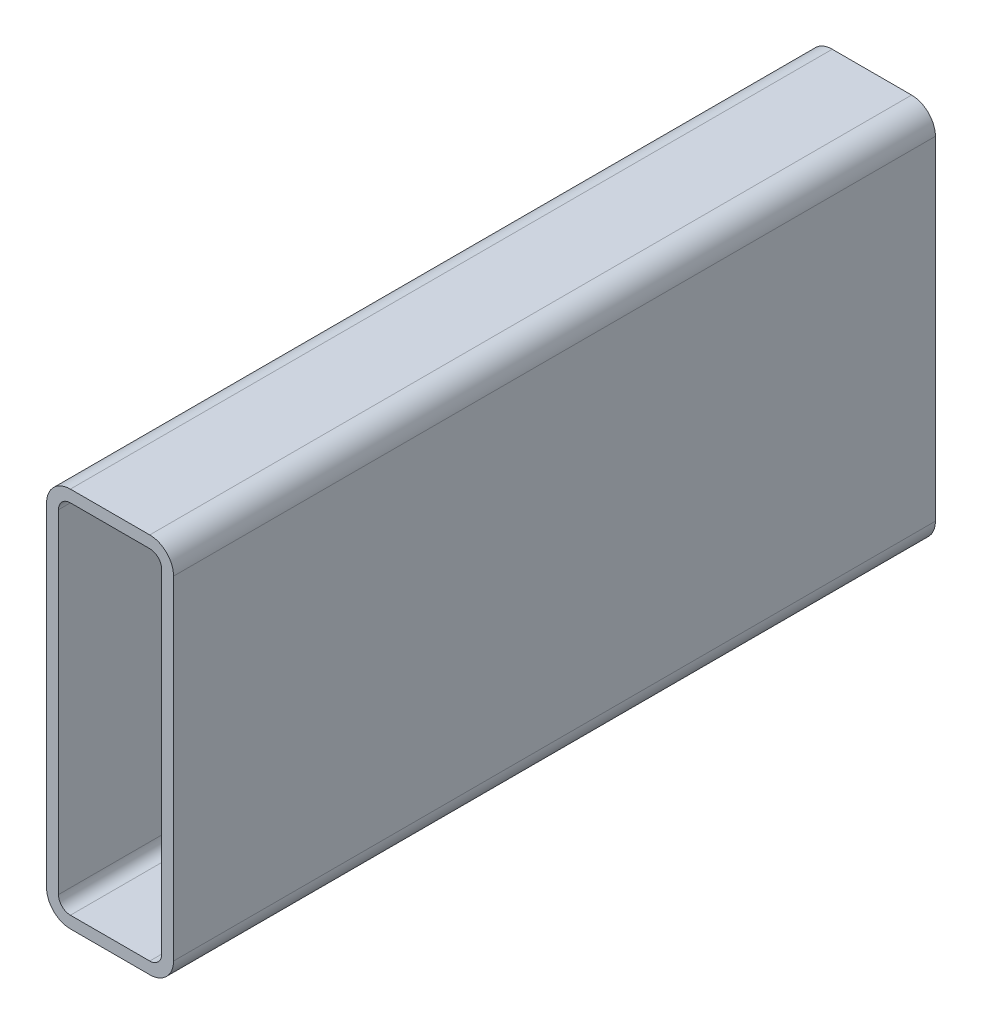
ISO-10303-21;
HEADER;
FILE_DESCRIPTION(('STEP AP214'),'2;1');
FILE_NAME('part.step','',(''),(''),'','','');
FILE_SCHEMA(('AUTOMOTIVE_DESIGN { 1 0 10303 214 1 1 1 1 }'));
ENDSEC;
DATA;
#1=APPLICATION_CONTEXT('core data for automotive mechanical design processes');
#2=APPLICATION_PROTOCOL_DEFINITION('international standard','automotive_design',2000,#1);
#3=PRODUCT_CONTEXT('',#1,'mechanical');
#4=PRODUCT('Part','Part','',(#3));
#5=PRODUCT_RELATED_PRODUCT_CATEGORY('part','',(#4));
#6=PRODUCT_DEFINITION_FORMATION('','',#4);
#7=PRODUCT_DEFINITION_CONTEXT('part definition',#1,'design');
#8=PRODUCT_DEFINITION('design','',#6,#7);
#9=PRODUCT_DEFINITION_SHAPE('','',#8);
#10=(LENGTH_UNIT() NAMED_UNIT(*) SI_UNIT(.MILLI.,.METRE.));
#11=(NAMED_UNIT(*) PLANE_ANGLE_UNIT() SI_UNIT($,.RADIAN.));
#12=(NAMED_UNIT(*) SI_UNIT($,.STERADIAN.) SOLID_ANGLE_UNIT());
#13=UNCERTAINTY_MEASURE_WITH_UNIT(LENGTH_MEASURE(1.E-05),#10,'distance_accuracy_value','');
#14=(GEOMETRIC_REPRESENTATION_CONTEXT(3) GLOBAL_UNCERTAINTY_ASSIGNED_CONTEXT((#13)) GLOBAL_UNIT_ASSIGNED_CONTEXT((#10,
#11,#12)) REPRESENTATION_CONTEXT('',''));
#15=CARTESIAN_POINT('',(0.,0.,0.));
#16=DIRECTION('',(0.,0.,1.));
#17=DIRECTION('',(1.,0.,0.));
#18=AXIS2_PLACEMENT_3D('',#15,#16,#17);
#19=CARTESIAN_POINT('',(9.52500000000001,142.875,304.8));
#20=DIRECTION('',(0.,0.,1.));
#21=DIRECTION('',(1.,0.,0.));
#22=AXIS2_PLACEMENT_3D('',#19,#20,#21);
#23=PLANE('',#22);
#24=CARTESIAN_POINT('',(9.52500000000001,142.875,304.8));
#25=DIRECTION('',(0.,0.,1.));
#26=DIRECTION('',(1.,0.,0.));
#27=AXIS2_PLACEMENT_3D('',#24,#25,#26);
#28=CIRCLE('',#27,9.52500000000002);
#29=CARTESIAN_POINT('',(9.525,152.4,304.8));
#30=VERTEX_POINT('',#29);
#31=CARTESIAN_POINT('',(0.,142.875,304.8));
#32=VERTEX_POINT('',#31);
#33=EDGE_CURVE('E211',#30,#32,#28,.T.);
#34=ORIENTED_EDGE('',*,*,#33,.T.);
#35=DIRECTION('',(0.,-1.,0.));
#36=VECTOR('',#35,1.);
#37=CARTESIAN_POINT('',(0.,9.525,304.8));
#38=LINE('',#37,#36);
#39=CARTESIAN_POINT('',(0.,9.525,304.8));
#40=VERTEX_POINT('',#39);
#41=EDGE_CURVE('E214',#32,#40,#38,.T.);
#42=ORIENTED_EDGE('',*,*,#41,.T.);
#43=CARTESIAN_POINT('',(9.525,9.525,304.8));
#44=DIRECTION('',(0.,0.,1.));
#45=DIRECTION('',(1.,0.,0.));
#46=AXIS2_PLACEMENT_3D('',#43,#44,#45);
#47=CIRCLE('',#46,9.525);
#48=CARTESIAN_POINT('',(9.525,0.,304.8));
#49=VERTEX_POINT('',#48);
#50=EDGE_CURVE('E217',#40,#49,#47,.T.);
#51=ORIENTED_EDGE('',*,*,#50,.T.);
#52=DIRECTION('',(1.,0.,0.));
#53=VECTOR('',#52,1.);
#54=CARTESIAN_POINT('',(41.275,0.,304.8));
#55=LINE('',#54,#53);
#56=CARTESIAN_POINT('',(41.275,0.,304.8));
#57=VERTEX_POINT('',#56);
#58=EDGE_CURVE('E219',#49,#57,#55,.T.);
#59=ORIENTED_EDGE('',*,*,#58,.T.);
#60=CARTESIAN_POINT('',(41.275,9.525,304.8));
#61=DIRECTION('',(0.,0.,1.));
#62=DIRECTION('',(1.,0.,0.));
#63=AXIS2_PLACEMENT_3D('',#60,#61,#62);
#64=CIRCLE('',#63,9.525);
#65=CARTESIAN_POINT('',(50.8,9.525,304.8));
#66=VERTEX_POINT('',#65);
#67=EDGE_CURVE('E221',#57,#66,#64,.T.);
#68=ORIENTED_EDGE('',*,*,#67,.T.);
#69=DIRECTION('',(0.,1.,0.));
#70=VECTOR('',#69,1.);
#71=CARTESIAN_POINT('',(50.8,142.875,304.8));
#72=LINE('',#71,#70);
#73=CARTESIAN_POINT('',(50.8,142.875,304.8));
#74=VERTEX_POINT('',#73);
#75=EDGE_CURVE('E223',#66,#74,#72,.T.);
#76=ORIENTED_EDGE('',*,*,#75,.T.);
#77=CARTESIAN_POINT('',(41.275,142.875,304.8));
#78=DIRECTION('',(0.,0.,1.));
#79=DIRECTION('',(1.,0.,0.));
#80=AXIS2_PLACEMENT_3D('',#77,#78,#79);
#81=CIRCLE('',#80,9.52500000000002);
#82=CARTESIAN_POINT('',(41.275,152.4,304.8));
#83=VERTEX_POINT('',#82);
#84=EDGE_CURVE('E225',#74,#83,#81,.T.);
#85=ORIENTED_EDGE('',*,*,#84,.T.);
#86=DIRECTION('',(-1.,0.,0.));
#87=VECTOR('',#86,1.);
#88=CARTESIAN_POINT('',(9.525,152.4,304.8));
#89=LINE('',#88,#87);
#90=EDGE_CURVE('E227',#83,#30,#89,.T.);
#91=ORIENTED_EDGE('',*,*,#90,.T.);
#92=EDGE_LOOP('',(#34,#42,#51,#59,#68,#76,#85,#91));
#93=FACE_BOUND('',#92,.T.);
#94=DIRECTION('',(0.,-1.,0.));
#95=VECTOR('',#94,1.);
#96=CARTESIAN_POINT('',(4.7625,9.525,304.8));
#97=LINE('',#96,#95);
#98=CARTESIAN_POINT('',(4.7625,142.875,304.8));
#99=VERTEX_POINT('',#98);
#100=CARTESIAN_POINT('',(4.7625,9.525,304.8));
#101=VERTEX_POINT('',#100);
#102=EDGE_CURVE('E154',#99,#101,#97,.T.);
#103=ORIENTED_EDGE('',*,*,#102,.F.);
#104=CARTESIAN_POINT('',(9.52500000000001,142.875,304.8));
#105=DIRECTION('',(0.,0.,1.));
#106=DIRECTION('',(1.,0.,0.));
#107=AXIS2_PLACEMENT_3D('',#104,#105,#106);
#108=CIRCLE('',#107,4.7625);
#109=CARTESIAN_POINT('',(9.525,147.6375,304.8));
#110=VERTEX_POINT('',#109);
#111=EDGE_CURVE('E146',#110,#99,#108,.T.);
#112=ORIENTED_EDGE('',*,*,#111,.F.);
#113=DIRECTION('',(-1.,0.,0.));
#114=VECTOR('',#113,1.);
#115=CARTESIAN_POINT('',(9.525,147.6375,304.8));
#116=LINE('',#115,#114);
#117=CARTESIAN_POINT('',(41.275,147.6375,304.8));
#118=VERTEX_POINT('',#117);
#119=EDGE_CURVE('E179',#118,#110,#116,.T.);
#120=ORIENTED_EDGE('',*,*,#119,.F.);
#121=CARTESIAN_POINT('',(41.275,142.875,304.8));
#122=DIRECTION('',(0.,0.,1.));
#123=DIRECTION('',(1.,0.,0.));
#124=AXIS2_PLACEMENT_3D('',#121,#122,#123);
#125=CIRCLE('',#124,4.7625);
#126=CARTESIAN_POINT('',(46.0375,142.875,304.8));
#127=VERTEX_POINT('',#126);
#128=EDGE_CURVE('E177',#127,#118,#125,.T.);
#129=ORIENTED_EDGE('',*,*,#128,.F.);
#130=DIRECTION('',(0.,1.,0.));
#131=VECTOR('',#130,1.);
#132=CARTESIAN_POINT('',(46.0375,142.875,304.8));
#133=LINE('',#132,#131);
#134=CARTESIAN_POINT('',(46.0375,9.525,304.8));
#135=VERTEX_POINT('',#134);
#136=EDGE_CURVE('E175',#135,#127,#133,.T.);
#137=ORIENTED_EDGE('',*,*,#136,.F.);
#138=CARTESIAN_POINT('',(41.275,9.525,304.8));
#139=DIRECTION('',(0.,0.,1.));
#140=DIRECTION('',(1.,0.,0.));
#141=AXIS2_PLACEMENT_3D('',#138,#139,#140);
#142=CIRCLE('',#141,4.7625);
#143=CARTESIAN_POINT('',(41.275,4.7625,304.8));
#144=VERTEX_POINT('',#143);
#145=EDGE_CURVE('E173',#144,#135,#142,.T.);
#146=ORIENTED_EDGE('',*,*,#145,.F.);
#147=DIRECTION('',(1.,0.,0.));
#148=VECTOR('',#147,1.);
#149=CARTESIAN_POINT('',(41.275,4.7625,304.8));
#150=LINE('',#149,#148);
#151=CARTESIAN_POINT('',(9.525,4.7625,304.8));
#152=VERTEX_POINT('',#151);
#153=EDGE_CURVE('E169',#152,#144,#150,.T.);
#154=ORIENTED_EDGE('',*,*,#153,.F.);
#155=CARTESIAN_POINT('',(9.525,9.525,304.8));
#156=DIRECTION('',(0.,0.,1.));
#157=DIRECTION('',(1.,0.,0.));
#158=AXIS2_PLACEMENT_3D('',#155,#156,#157);
#159=CIRCLE('',#158,4.7625);
#160=EDGE_CURVE('E167',#101,#152,#159,.T.);
#161=ORIENTED_EDGE('',*,*,#160,.F.);
#162=EDGE_LOOP('',(#103,#112,#120,#129,#137,#146,#154,#161));
#163=FACE_BOUND('',#162,.T.);
#164=ADVANCED_FACE('F33',(#93,#163),#23,.T.);
#165=CARTESIAN_POINT('',(9.52500000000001,142.875,0.));
#166=DIRECTION('',(0.,0.,1.));
#167=DIRECTION('',(1.,0.,0.));
#168=AXIS2_PLACEMENT_3D('',#165,#166,#167);
#169=PLANE('',#168);
#170=CARTESIAN_POINT('',(9.52500000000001,142.875,0.));
#171=DIRECTION('',(0.,0.,1.));
#172=DIRECTION('',(1.,0.,0.));
#173=AXIS2_PLACEMENT_3D('',#170,#171,#172);
#174=CIRCLE('',#173,9.52500000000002);
#175=CARTESIAN_POINT('',(9.525,152.4,0.));
#176=VERTEX_POINT('',#175);
#177=CARTESIAN_POINT('',(0.,142.875,0.));
#178=VERTEX_POINT('',#177);
#179=EDGE_CURVE('E162',#176,#178,#174,.T.);
#180=ORIENTED_EDGE('',*,*,#179,.F.);
#181=DIRECTION('',(-1.,0.,0.));
#182=VECTOR('',#181,1.);
#183=CARTESIAN_POINT('',(9.525,152.4,0.));
#184=LINE('',#183,#182);
#185=CARTESIAN_POINT('',(41.275,152.4,0.));
#186=VERTEX_POINT('',#185);
#187=EDGE_CURVE('E215',#186,#176,#184,.T.);
#188=ORIENTED_EDGE('',*,*,#187,.F.);
#189=CARTESIAN_POINT('',(41.275,142.875,0.));
#190=DIRECTION('',(0.,0.,1.));
#191=DIRECTION('',(1.,0.,0.));
#192=AXIS2_PLACEMENT_3D('',#189,#190,#191);
#193=CIRCLE('',#192,9.52500000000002);
#194=CARTESIAN_POINT('',(50.8,142.875,0.));
#195=VERTEX_POINT('',#194);
#196=EDGE_CURVE('E242',#195,#186,#193,.T.);
#197=ORIENTED_EDGE('',*,*,#196,.F.);
#198=DIRECTION('',(0.,1.,0.));
#199=VECTOR('',#198,1.);
#200=CARTESIAN_POINT('',(50.8,142.875,0.));
#201=LINE('',#200,#199);
#202=CARTESIAN_POINT('',(50.8,9.525,0.));
#203=VERTEX_POINT('',#202);
#204=EDGE_CURVE('E240',#203,#195,#201,.T.);
#205=ORIENTED_EDGE('',*,*,#204,.F.);
#206=CARTESIAN_POINT('',(41.275,9.525,0.));
#207=DIRECTION('',(0.,0.,1.));
#208=DIRECTION('',(1.,0.,0.));
#209=AXIS2_PLACEMENT_3D('',#206,#207,#208);
#210=CIRCLE('',#209,9.525);
#211=CARTESIAN_POINT('',(41.275,0.,0.));
#212=VERTEX_POINT('',#211);
#213=EDGE_CURVE('E238',#212,#203,#210,.T.);
#214=ORIENTED_EDGE('',*,*,#213,.F.);
#215=DIRECTION('',(1.,0.,0.));
#216=VECTOR('',#215,1.);
#217=CARTESIAN_POINT('',(41.275,0.,0.));
#218=LINE('',#217,#216);
#219=CARTESIAN_POINT('',(9.525,0.,0.));
#220=VERTEX_POINT('',#219);
#221=EDGE_CURVE('E236',#220,#212,#218,.T.);
#222=ORIENTED_EDGE('',*,*,#221,.F.);
#223=CARTESIAN_POINT('',(9.525,9.525,0.));
#224=DIRECTION('',(0.,0.,1.));
#225=DIRECTION('',(1.,0.,0.));
#226=AXIS2_PLACEMENT_3D('',#223,#224,#225);
#227=CIRCLE('',#226,9.525);
#228=CARTESIAN_POINT('',(0.,9.525,0.));
#229=VERTEX_POINT('',#228);
#230=EDGE_CURVE('E234',#229,#220,#227,.T.);
#231=ORIENTED_EDGE('',*,*,#230,.F.);
#232=DIRECTION('',(0.,-1.,0.));
#233=VECTOR('',#232,1.);
#234=CARTESIAN_POINT('',(0.,9.525,0.));
#235=LINE('',#234,#233);
#236=EDGE_CURVE('E232',#178,#229,#235,.T.);
#237=ORIENTED_EDGE('',*,*,#236,.F.);
#238=EDGE_LOOP('',(#180,#188,#197,#205,#214,#222,#231,#237));
#239=FACE_BOUND('',#238,.T.);
#240=CARTESIAN_POINT('',(9.52500000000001,142.875,0.));
#241=DIRECTION('',(0.,0.,1.));
#242=DIRECTION('',(1.,0.,0.));
#243=AXIS2_PLACEMENT_3D('',#240,#241,#242);
#244=CIRCLE('',#243,4.7625);
#245=CARTESIAN_POINT('',(9.525,147.6375,0.));
#246=VERTEX_POINT('',#245);
#247=CARTESIAN_POINT('',(4.7625,142.875,0.));
#248=VERTEX_POINT('',#247);
#249=EDGE_CURVE('E56',#246,#248,#244,.T.);
#250=ORIENTED_EDGE('',*,*,#249,.T.);
#251=DIRECTION('',(0.,-1.,0.));
#252=VECTOR('',#251,1.);
#253=CARTESIAN_POINT('',(4.7625,9.525,0.));
#254=LINE('',#253,#252);
#255=CARTESIAN_POINT('',(4.7625,9.525,0.));
#256=VERTEX_POINT('',#255);
#257=EDGE_CURVE('E161',#248,#256,#254,.T.);
#258=ORIENTED_EDGE('',*,*,#257,.T.);
#259=CARTESIAN_POINT('',(9.525,9.525,0.));
#260=DIRECTION('',(0.,0.,1.));
#261=DIRECTION('',(1.,0.,0.));
#262=AXIS2_PLACEMENT_3D('',#259,#260,#261);
#263=CIRCLE('',#262,4.7625);
#264=CARTESIAN_POINT('',(9.525,4.7625,0.));
#265=VERTEX_POINT('',#264);
#266=EDGE_CURVE('E183',#256,#265,#263,.T.);
#267=ORIENTED_EDGE('',*,*,#266,.T.);
#268=DIRECTION('',(1.,0.,0.));
#269=VECTOR('',#268,1.);
#270=CARTESIAN_POINT('',(41.275,4.7625,0.));
#271=LINE('',#270,#269);
#272=CARTESIAN_POINT('',(41.275,4.7625,0.));
#273=VERTEX_POINT('',#272);
#274=EDGE_CURVE('E186',#265,#273,#271,.T.);
#275=ORIENTED_EDGE('',*,*,#274,.T.);
#276=CARTESIAN_POINT('',(41.275,9.525,0.));
#277=DIRECTION('',(0.,0.,1.));
#278=DIRECTION('',(1.,0.,0.));
#279=AXIS2_PLACEMENT_3D('',#276,#277,#278);
#280=CIRCLE('',#279,4.7625);
#281=CARTESIAN_POINT('',(46.0375,9.525,0.));
#282=VERTEX_POINT('',#281);
#283=EDGE_CURVE('E189',#273,#282,#280,.T.);
#284=ORIENTED_EDGE('',*,*,#283,.T.);
#285=DIRECTION('',(0.,1.,0.));
#286=VECTOR('',#285,1.);
#287=CARTESIAN_POINT('',(46.0375,142.875,0.));
#288=LINE('',#287,#286);
#289=CARTESIAN_POINT('',(46.0375,142.875,0.));
#290=VERTEX_POINT('',#289);
#291=EDGE_CURVE('E192',#282,#290,#288,.T.);
#292=ORIENTED_EDGE('',*,*,#291,.T.);
#293=CARTESIAN_POINT('',(41.275,142.875,0.));
#294=DIRECTION('',(0.,0.,1.));
#295=DIRECTION('',(1.,0.,0.));
#296=AXIS2_PLACEMENT_3D('',#293,#294,#295);
#297=CIRCLE('',#296,4.7625);
#298=CARTESIAN_POINT('',(41.275,147.6375,0.));
#299=VERTEX_POINT('',#298);
#300=EDGE_CURVE('E195',#290,#299,#297,.T.);
#301=ORIENTED_EDGE('',*,*,#300,.T.);
#302=DIRECTION('',(-1.,0.,0.));
#303=VECTOR('',#302,1.);
#304=CARTESIAN_POINT('',(9.525,147.6375,0.));
#305=LINE('',#304,#303);
#306=EDGE_CURVE('E155',#299,#246,#305,.T.);
#307=ORIENTED_EDGE('',*,*,#306,.T.);
#308=EDGE_LOOP('',(#250,#258,#267,#275,#284,#292,#301,#307));
#309=FACE_BOUND('',#308,.T.);
#310=ADVANCED_FACE('F272',(#239,#309),#169,.F.);
#311=CARTESIAN_POINT('',(9.52500000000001,142.875,304.8));
#312=DIRECTION('',(0.,0.,-1.));
#313=DIRECTION('',(-1.,0.,0.));
#314=AXIS2_PLACEMENT_3D('',#311,#312,#313);
#315=CYLINDRICAL_SURFACE('',#314,9.52500000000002);
#316=ORIENTED_EDGE('',*,*,#179,.T.);
#317=DIRECTION('',(0.,0.,-1.));
#318=VECTOR('',#317,1.);
#319=CARTESIAN_POINT('',(0.,142.875,304.8));
#320=LINE('',#319,#318);
#321=EDGE_CURVE('E11',#32,#178,#320,.T.);
#322=ORIENTED_EDGE('',*,*,#321,.F.);
#323=ORIENTED_EDGE('',*,*,#33,.F.);
#324=DIRECTION('',(0.,0.,-1.));
#325=VECTOR('',#324,1.);
#326=CARTESIAN_POINT('',(9.525,152.4,304.8));
#327=LINE('',#326,#325);
#328=EDGE_CURVE('E229',#30,#176,#327,.T.);
#329=ORIENTED_EDGE('',*,*,#328,.T.);
#330=EDGE_LOOP('',(#316,#322,#323,#329));
#331=FACE_BOUND('',#330,.T.);
#332=ADVANCED_FACE('F35',(#331),#315,.T.);
#333=CARTESIAN_POINT('',(0.,9.525,304.8));
#334=DIRECTION('',(1.,0.,0.));
#335=DIRECTION('',(0.,0.,-1.));
#336=AXIS2_PLACEMENT_3D('',#333,#334,#335);
#337=PLANE('',#336);
#338=ORIENTED_EDGE('',*,*,#236,.T.);
#339=DIRECTION('',(0.,0.,-1.));
#340=VECTOR('',#339,1.);
#341=CARTESIAN_POINT('',(0.,9.525,304.8));
#342=LINE('',#341,#340);
#343=EDGE_CURVE('E41',#40,#229,#342,.T.);
#344=ORIENTED_EDGE('',*,*,#343,.F.);
#345=ORIENTED_EDGE('',*,*,#41,.F.);
#346=ORIENTED_EDGE('',*,*,#321,.T.);
#347=EDGE_LOOP('',(#338,#344,#345,#346));
#348=FACE_BOUND('',#347,.T.);
#349=ADVANCED_FACE('F289',(#348),#337,.F.);
#350=CARTESIAN_POINT('',(9.525,9.525,304.8));
#351=DIRECTION('',(0.,0.,-1.));
#352=DIRECTION('',(-1.,0.,0.));
#353=AXIS2_PLACEMENT_3D('',#350,#351,#352);
#354=CYLINDRICAL_SURFACE('',#353,9.525);
#355=ORIENTED_EDGE('',*,*,#230,.T.);
#356=DIRECTION('',(0.,0.,-1.));
#357=VECTOR('',#356,1.);
#358=CARTESIAN_POINT('',(9.525,0.,304.8));
#359=LINE('',#358,#357);
#360=EDGE_CURVE('E259',#49,#220,#359,.T.);
#361=ORIENTED_EDGE('',*,*,#360,.F.);
#362=ORIENTED_EDGE('',*,*,#50,.F.);
#363=ORIENTED_EDGE('',*,*,#343,.T.);
#364=EDGE_LOOP('',(#355,#361,#362,#363));
#365=FACE_BOUND('',#364,.T.);
#366=ADVANCED_FACE('F266',(#365),#354,.T.);
#367=CARTESIAN_POINT('',(41.275,0.,304.8));
#368=DIRECTION('',(0.,1.,0.));
#369=DIRECTION('',(0.,0.,1.));
#370=AXIS2_PLACEMENT_3D('',#367,#368,#369);
#371=PLANE('',#370);
#372=ORIENTED_EDGE('',*,*,#221,.T.);
#373=DIRECTION('',(0.,0.,-1.));
#374=VECTOR('',#373,1.);
#375=CARTESIAN_POINT('',(41.275,0.,304.8));
#376=LINE('',#375,#374);
#377=EDGE_CURVE('E256',#57,#212,#376,.T.);
#378=ORIENTED_EDGE('',*,*,#377,.F.);
#379=ORIENTED_EDGE('',*,*,#58,.F.);
#380=ORIENTED_EDGE('',*,*,#360,.T.);
#381=EDGE_LOOP('',(#372,#378,#379,#380));
#382=FACE_BOUND('',#381,.T.);
#383=ADVANCED_FACE('F278',(#382),#371,.F.);
#384=CARTESIAN_POINT('',(41.275,9.525,304.8));
#385=DIRECTION('',(0.,0.,-1.));
#386=DIRECTION('',(-1.,0.,0.));
#387=AXIS2_PLACEMENT_3D('',#384,#385,#386);
#388=CYLINDRICAL_SURFACE('',#387,9.525);
#389=ORIENTED_EDGE('',*,*,#213,.T.);
#390=DIRECTION('',(0.,0.,-1.));
#391=VECTOR('',#390,1.);
#392=CARTESIAN_POINT('',(50.8,9.525,304.8));
#393=LINE('',#392,#391);
#394=EDGE_CURVE('E253',#66,#203,#393,.T.);
#395=ORIENTED_EDGE('',*,*,#394,.F.);
#396=ORIENTED_EDGE('',*,*,#67,.F.);
#397=ORIENTED_EDGE('',*,*,#377,.T.);
#398=EDGE_LOOP('',(#389,#395,#396,#397));
#399=FACE_BOUND('',#398,.T.);
#400=ADVANCED_FACE('F282',(#399),#388,.T.);
#401=CARTESIAN_POINT('',(50.8,142.875,304.8));
#402=DIRECTION('',(-1.,0.,0.));
#403=DIRECTION('',(0.,0.,1.));
#404=AXIS2_PLACEMENT_3D('',#401,#402,#403);
#405=PLANE('',#404);
#406=ORIENTED_EDGE('',*,*,#204,.T.);
#407=DIRECTION('',(0.,0.,-1.));
#408=VECTOR('',#407,1.);
#409=CARTESIAN_POINT('',(50.8,142.875,304.8));
#410=LINE('',#409,#408);
#411=EDGE_CURVE('E250',#74,#195,#410,.T.);
#412=ORIENTED_EDGE('',*,*,#411,.F.);
#413=ORIENTED_EDGE('',*,*,#75,.F.);
#414=ORIENTED_EDGE('',*,*,#394,.T.);
#415=EDGE_LOOP('',(#406,#412,#413,#414));
#416=FACE_BOUND('',#415,.T.);
#417=ADVANCED_FACE('F302',(#416),#405,.F.);
#418=CARTESIAN_POINT('',(41.275,142.875,304.8));
#419=DIRECTION('',(0.,0.,-1.));
#420=DIRECTION('',(-1.,0.,0.));
#421=AXIS2_PLACEMENT_3D('',#418,#419,#420);
#422=CYLINDRICAL_SURFACE('',#421,9.52500000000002);
#423=ORIENTED_EDGE('',*,*,#196,.T.);
#424=DIRECTION('',(0.,0.,-1.));
#425=VECTOR('',#424,1.);
#426=CARTESIAN_POINT('',(41.275,152.4,304.8));
#427=LINE('',#426,#425);
#428=EDGE_CURVE('E247',#83,#186,#427,.T.);
#429=ORIENTED_EDGE('',*,*,#428,.F.);
#430=ORIENTED_EDGE('',*,*,#84,.F.);
#431=ORIENTED_EDGE('',*,*,#411,.T.);
#432=EDGE_LOOP('',(#423,#429,#430,#431));
#433=FACE_BOUND('',#432,.T.);
#434=ADVANCED_FACE('F300',(#433),#422,.T.);
#435=CARTESIAN_POINT('',(9.525,152.4,304.8));
#436=DIRECTION('',(0.,-1.,0.));
#437=DIRECTION('',(0.,0.,-1.));
#438=AXIS2_PLACEMENT_3D('',#435,#436,#437);
#439=PLANE('',#438);
#440=ORIENTED_EDGE('',*,*,#187,.T.);
#441=ORIENTED_EDGE('',*,*,#328,.F.);
#442=ORIENTED_EDGE('',*,*,#90,.F.);
#443=ORIENTED_EDGE('',*,*,#428,.T.);
#444=EDGE_LOOP('',(#440,#441,#442,#443));
#445=FACE_BOUND('',#444,.T.);
#446=ADVANCED_FACE('F295',(#445),#439,.F.);
#447=CARTESIAN_POINT('',(9.52500000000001,142.875,304.8));
#448=DIRECTION('',(0.,0.,-1.));
#449=DIRECTION('',(-1.,0.,0.));
#450=AXIS2_PLACEMENT_3D('',#447,#448,#449);
#451=CYLINDRICAL_SURFACE('',#450,4.7625);
#452=ORIENTED_EDGE('',*,*,#249,.F.);
#453=DIRECTION('',(0.,0.,-1.));
#454=VECTOR('',#453,1.);
#455=CARTESIAN_POINT('',(9.525,147.6375,304.8));
#456=LINE('',#455,#454);
#457=EDGE_CURVE('E150',#110,#246,#456,.T.);
#458=ORIENTED_EDGE('',*,*,#457,.F.);
#459=ORIENTED_EDGE('',*,*,#111,.T.);
#460=DIRECTION('',(0.,0.,-1.));
#461=VECTOR('',#460,1.);
#462=CARTESIAN_POINT('',(4.7625,142.875,304.8));
#463=LINE('',#462,#461);
#464=EDGE_CURVE('E149',#99,#248,#463,.T.);
#465=ORIENTED_EDGE('',*,*,#464,.T.);
#466=EDGE_LOOP('',(#452,#458,#459,#465));
#467=FACE_BOUND('',#466,.T.);
#468=ADVANCED_FACE('F148',(#467),#451,.F.);
#469=CARTESIAN_POINT('',(4.7625,9.525,304.8));
#470=DIRECTION('',(1.,0.,0.));
#471=DIRECTION('',(0.,0.,-1.));
#472=AXIS2_PLACEMENT_3D('',#469,#470,#471);
#473=PLANE('',#472);
#474=ORIENTED_EDGE('',*,*,#257,.F.);
#475=ORIENTED_EDGE('',*,*,#464,.F.);
#476=ORIENTED_EDGE('',*,*,#102,.T.);
#477=DIRECTION('',(0.,0.,-1.));
#478=VECTOR('',#477,1.);
#479=CARTESIAN_POINT('',(4.7625,9.525,304.8));
#480=LINE('',#479,#478);
#481=EDGE_CURVE('E163',#101,#256,#480,.T.);
#482=ORIENTED_EDGE('',*,*,#481,.T.);
#483=EDGE_LOOP('',(#474,#475,#476,#482));
#484=FACE_BOUND('',#483,.T.);
#485=ADVANCED_FACE('F158',(#484),#473,.T.);
#486=CARTESIAN_POINT('',(9.525,9.525,304.8));
#487=DIRECTION('',(0.,0.,-1.));
#488=DIRECTION('',(-1.,0.,0.));
#489=AXIS2_PLACEMENT_3D('',#486,#487,#488);
#490=CYLINDRICAL_SURFACE('',#489,4.7625);
#491=ORIENTED_EDGE('',*,*,#266,.F.);
#492=ORIENTED_EDGE('',*,*,#481,.F.);
#493=ORIENTED_EDGE('',*,*,#160,.T.);
#494=DIRECTION('',(0.,0.,-1.));
#495=VECTOR('',#494,1.);
#496=CARTESIAN_POINT('',(9.525,4.7625,304.8));
#497=LINE('',#496,#495);
#498=EDGE_CURVE('E208',#152,#265,#497,.T.);
#499=ORIENTED_EDGE('',*,*,#498,.T.);
#500=EDGE_LOOP('',(#491,#492,#493,#499));
#501=FACE_BOUND('',#500,.T.);
#502=ADVANCED_FACE('F327',(#501),#490,.F.);
#503=CARTESIAN_POINT('',(41.275,4.7625,304.8));
#504=DIRECTION('',(0.,1.,0.));
#505=DIRECTION('',(0.,0.,1.));
#506=AXIS2_PLACEMENT_3D('',#503,#504,#505);
#507=PLANE('',#506);
#508=ORIENTED_EDGE('',*,*,#274,.F.);
#509=ORIENTED_EDGE('',*,*,#498,.F.);
#510=ORIENTED_EDGE('',*,*,#153,.T.);
#511=DIRECTION('',(0.,0.,-1.));
#512=VECTOR('',#511,1.);
#513=CARTESIAN_POINT('',(41.275,4.7625,304.8));
#514=LINE('',#513,#512);
#515=EDGE_CURVE('E206',#144,#273,#514,.T.);
#516=ORIENTED_EDGE('',*,*,#515,.T.);
#517=EDGE_LOOP('',(#508,#509,#510,#516));
#518=FACE_BOUND('',#517,.T.);
#519=ADVANCED_FACE('F331',(#518),#507,.T.);
#520=CARTESIAN_POINT('',(41.275,9.525,304.8));
#521=DIRECTION('',(0.,0.,-1.));
#522=DIRECTION('',(-1.,0.,0.));
#523=AXIS2_PLACEMENT_3D('',#520,#521,#522);
#524=CYLINDRICAL_SURFACE('',#523,4.7625);
#525=ORIENTED_EDGE('',*,*,#283,.F.);
#526=ORIENTED_EDGE('',*,*,#515,.F.);
#527=ORIENTED_EDGE('',*,*,#145,.T.);
#528=DIRECTION('',(0.,0.,-1.));
#529=VECTOR('',#528,1.);
#530=CARTESIAN_POINT('',(46.0375,9.525,304.8));
#531=LINE('',#530,#529);
#532=EDGE_CURVE('E204',#135,#282,#531,.T.);
#533=ORIENTED_EDGE('',*,*,#532,.T.);
#534=EDGE_LOOP('',(#525,#526,#527,#533));
#535=FACE_BOUND('',#534,.T.);
#536=ADVANCED_FACE('F337',(#535),#524,.F.);
#537=CARTESIAN_POINT('',(46.0375,142.875,304.8));
#538=DIRECTION('',(-1.,0.,0.));
#539=DIRECTION('',(0.,0.,1.));
#540=AXIS2_PLACEMENT_3D('',#537,#538,#539);
#541=PLANE('',#540);
#542=ORIENTED_EDGE('',*,*,#291,.F.);
#543=ORIENTED_EDGE('',*,*,#532,.F.);
#544=ORIENTED_EDGE('',*,*,#136,.T.);
#545=DIRECTION('',(0.,0.,-1.));
#546=VECTOR('',#545,1.);
#547=CARTESIAN_POINT('',(46.0375,142.875,304.8));
#548=LINE('',#547,#546);
#549=EDGE_CURVE('E202',#127,#290,#548,.T.);
#550=ORIENTED_EDGE('',*,*,#549,.T.);
#551=EDGE_LOOP('',(#542,#543,#544,#550));
#552=FACE_BOUND('',#551,.T.);
#553=ADVANCED_FACE('F341',(#552),#541,.T.);
#554=CARTESIAN_POINT('',(41.275,142.875,304.8));
#555=DIRECTION('',(0.,0.,-1.));
#556=DIRECTION('',(-1.,0.,0.));
#557=AXIS2_PLACEMENT_3D('',#554,#555,#556);
#558=CYLINDRICAL_SURFACE('',#557,4.7625);
#559=ORIENTED_EDGE('',*,*,#300,.F.);
#560=ORIENTED_EDGE('',*,*,#549,.F.);
#561=ORIENTED_EDGE('',*,*,#128,.T.);
#562=DIRECTION('',(0.,0.,-1.));
#563=VECTOR('',#562,1.);
#564=CARTESIAN_POINT('',(41.275,147.6375,304.8));
#565=LINE('',#564,#563);
#566=EDGE_CURVE('E48',#118,#299,#565,.T.);
#567=ORIENTED_EDGE('',*,*,#566,.T.);
#568=EDGE_LOOP('',(#559,#560,#561,#567));
#569=FACE_BOUND('',#568,.T.);
#570=ADVANCED_FACE('F345',(#569),#558,.F.);
#571=CARTESIAN_POINT('',(9.525,147.6375,304.8));
#572=DIRECTION('',(0.,-1.,0.));
#573=DIRECTION('',(0.,0.,-1.));
#574=AXIS2_PLACEMENT_3D('',#571,#572,#573);
#575=PLANE('',#574);
#576=ORIENTED_EDGE('',*,*,#306,.F.);
#577=ORIENTED_EDGE('',*,*,#566,.F.);
#578=ORIENTED_EDGE('',*,*,#119,.T.);
#579=ORIENTED_EDGE('',*,*,#457,.T.);
#580=EDGE_LOOP('',(#576,#577,#578,#579));
#581=FACE_BOUND('',#580,.T.);
#582=ADVANCED_FACE('F349',(#581),#575,.T.);
#583=CLOSED_SHELL('',(#164,#310,#332,#349,#366,#383,#400,#417,#434,#446,#468,#485,#502,#519,
#536,#553,#570,#582));
#584=MANIFOLD_SOLID_BREP('B2',#583);
#585=ADVANCED_BREP_SHAPE_REPRESENTATION('',(#18,#584),#14);
#586=SHAPE_DEFINITION_REPRESENTATION(#9,#585);
ENDSEC;
END-ISO-10303-21;
